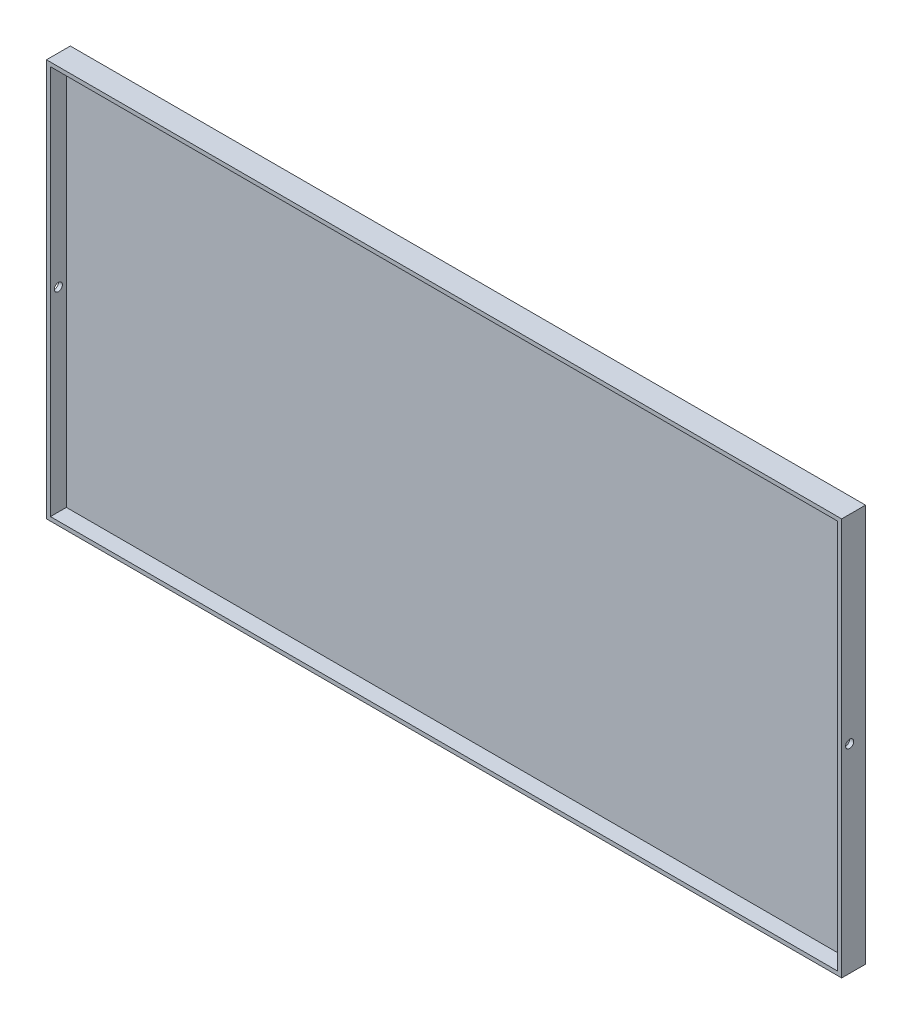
from build123d import *

# Parameters (mm, degrees)
SKETCH1_W           = 1000
SKETCH1_H           = 500
BOSS_EXTRUDE1_DEPTH = 20
SKETCH2_W           = 990
SKETCH2_H           = 490
CUT_EXTRUDE1_DEPTH  = 560.374650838
SKETCH4_R           = 5.08
CUT_EXTRUDE2_DEPTH  = 10
CUT_EXTRUDE3_START  = -10
SKETCH5_R           = 5.08
CUT_EXTRUDE3_DEPTH  = 10
SKETCH6_W           = 1000
SKETCH6_H           = 500
BOSS_EXTRUDE3_DEPTH = 10


with BuildPart() as part:
    # Sketch1 → Boss-Extrude1 (new body)
    with BuildSketch(Plane.XY):
        Rectangle(SKETCH1_W, SKETCH1_H)
    extrude(amount=BOSS_EXTRUDE1_DEPTH)

    # Sketch2 → Cut-Extrude1 (cut, through all)
    with BuildSketch(Plane.XY.offset(20)):
        Rectangle(SKETCH2_W, SKETCH2_H)
    extrude(amount=-CUT_EXTRUDE1_DEPTH, mode=Mode.SUBTRACT)

    # Sketch4 → Cut-Extrude2 (cut)
    with BuildSketch(Plane.ZY.offset(500)):
        with Locations(Location((10, 0, 0), (0, 0, 270))):
            Circle(SKETCH4_R)
    extrude(amount=-CUT_EXTRUDE2_DEPTH, mode=Mode.SUBTRACT)

    # Sketch5 → Cut-Extrude3 (cut)
    with BuildSketch(Plane(origin=(500, 0, 0), x_dir=(0, 0, -1), z_dir=(1, 0, 0)).offset(CUT_EXTRUDE3_START)):
        with Locations(Location((-10, 0, 0), (0, 0, 270))):
            Circle(SKETCH5_R)
    extrude(amount=CUT_EXTRUDE3_DEPTH, mode=Mode.SUBTRACT)

    # Sketch6 → Boss-Extrude3 (add)
    with BuildSketch(Plane.XY):
        Rectangle(SKETCH6_W, SKETCH6_H)
    extrude(amount=-BOSS_EXTRUDE3_DEPTH)


solid = part.part
